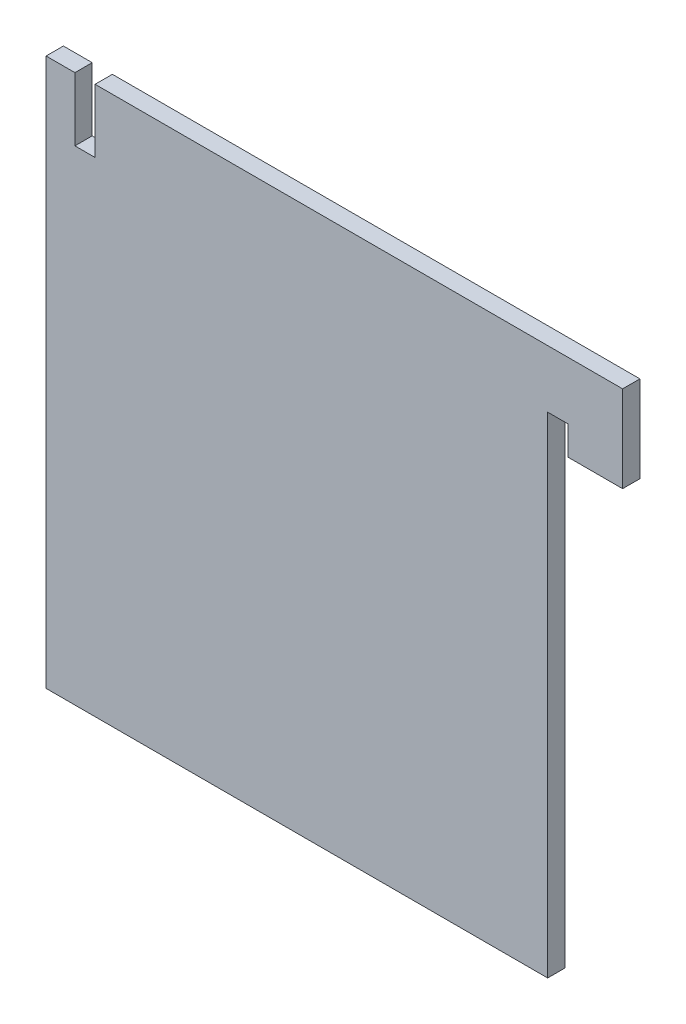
from build123d import *

# Parameters (mm, degrees)
ESQUISSE1_W             = 100
ESQUISSE1_H             = 95
EXTRUSION1_DEPTH        = 3
ESQUISSE2_W             = 13
ESQUISSE2_H             = 80
ENL_V_MAT_EXTRU_1_DEPTH = 3
ESQUISSE3_W             = 3.5
ESQUISSE3_H             = 11
ENL_V_MAT_EXTRU_2_DEPTH = 3
ESQUISSE4_W             = 3.5
ESQUISSE4_H             = 5
ENL_V_MAT_EXTRU_3_DEPTH = 3


with BuildPart() as part:
    # Esquisse1 → Extrusion1 (new body)
    with BuildSketch(Plane.XY):
        with Locations((50, 47.5)):
            Rectangle(ESQUISSE1_W, ESQUISSE1_H)
    extrude(amount=EXTRUSION1_DEPTH)

    # Esquisse2 → Enl_v. mat.-Extru.1 (cut)
    with BuildSketch(Plane.XY.offset(3)):
        with Locations((93.5, 40)):
            Rectangle(ESQUISSE2_W, ESQUISSE2_H)
    extrude(amount=-ENL_V_MAT_EXTRU_1_DEPTH, mode=Mode.SUBTRACT)

    # Esquisse3 → Enl_v. mat.-Extru.2 (cut)
    with BuildSketch(Plane.XY.offset(3)):
        with Locations((6.75, 89.5)):
            Rectangle(ESQUISSE3_W, ESQUISSE3_H)
    extrude(amount=-ENL_V_MAT_EXTRU_2_DEPTH, mode=Mode.SUBTRACT)

    # Esquisse4 → Enl_v. mat.-Extru.3 (cut)
    with BuildSketch(Plane.XY.offset(3)):
        with Locations((88.75, 82.5)):
            Rectangle(ESQUISSE4_W, ESQUISSE4_H)
    extrude(amount=-ENL_V_MAT_EXTRU_3_DEPTH, mode=Mode.SUBTRACT)


solid = part.part
